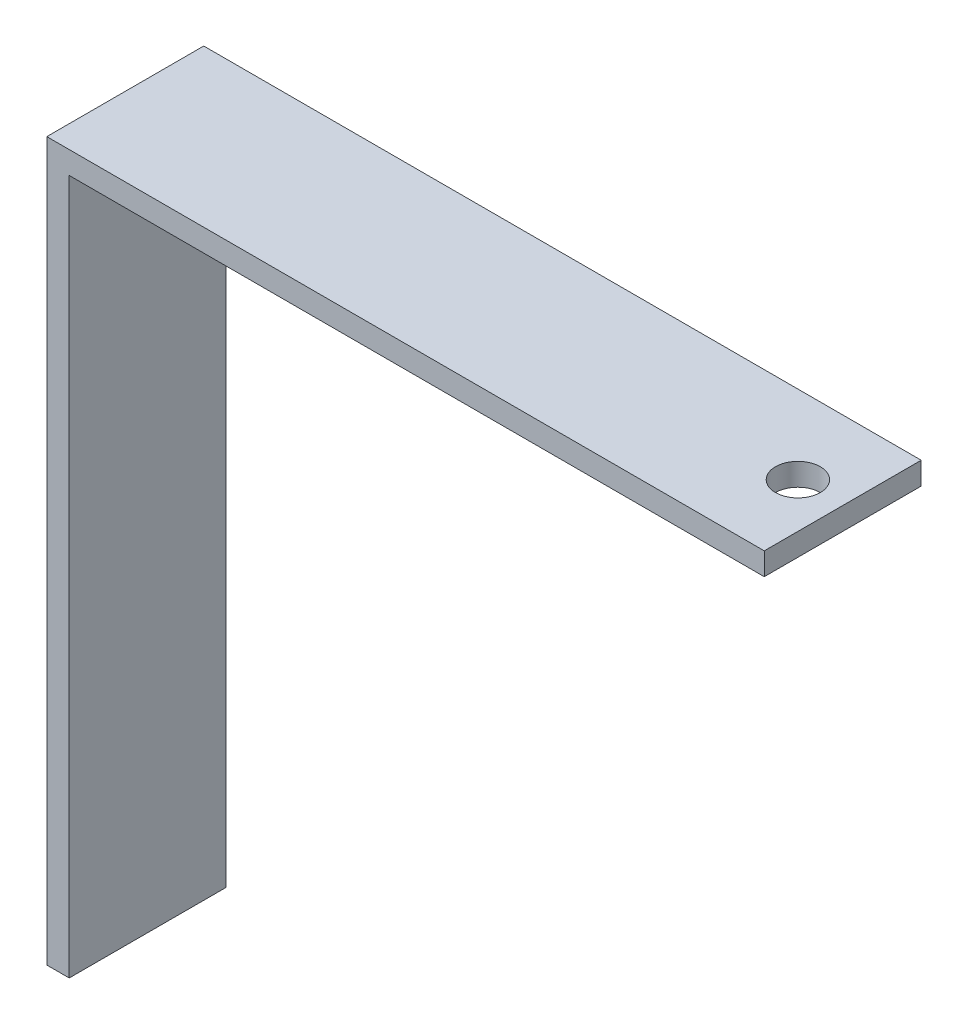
ISO-10303-21;
HEADER;
FILE_DESCRIPTION(('STEP AP214'),'2;1');
FILE_NAME('part.step','',(''),(''),'','','');
FILE_SCHEMA(('AUTOMOTIVE_DESIGN { 1 0 10303 214 1 1 1 1 }'));
ENDSEC;
DATA;
#1=APPLICATION_CONTEXT('core data for automotive mechanical design processes');
#2=APPLICATION_PROTOCOL_DEFINITION('international standard','automotive_design',2000,#1);
#3=PRODUCT_CONTEXT('',#1,'mechanical');
#4=PRODUCT('Part','Part','',(#3));
#5=PRODUCT_RELATED_PRODUCT_CATEGORY('part','',(#4));
#6=PRODUCT_DEFINITION_FORMATION('','',#4);
#7=PRODUCT_DEFINITION_CONTEXT('part definition',#1,'design');
#8=PRODUCT_DEFINITION('design','',#6,#7);
#9=PRODUCT_DEFINITION_SHAPE('','',#8);
#10=(LENGTH_UNIT() NAMED_UNIT(*) SI_UNIT(.MILLI.,.METRE.));
#11=(NAMED_UNIT(*) PLANE_ANGLE_UNIT() SI_UNIT($,.RADIAN.));
#12=(NAMED_UNIT(*) SI_UNIT($,.STERADIAN.) SOLID_ANGLE_UNIT());
#13=UNCERTAINTY_MEASURE_WITH_UNIT(LENGTH_MEASURE(1.E-05),#10,'distance_accuracy_value','');
#14=(GEOMETRIC_REPRESENTATION_CONTEXT(3) GLOBAL_UNCERTAINTY_ASSIGNED_CONTEXT((#13)) GLOBAL_UNIT_ASSIGNED_CONTEXT((#10,
#11,#12)) REPRESENTATION_CONTEXT('',''));
#15=CARTESIAN_POINT('',(0.,0.,0.));
#16=DIRECTION('',(0.,0.,1.));
#17=DIRECTION('',(1.,0.,0.));
#18=AXIS2_PLACEMENT_3D('',#15,#16,#17);
#19=CARTESIAN_POINT('',(0.,98.425,22.225));
#20=DIRECTION('',(0.,1.,0.));
#21=DIRECTION('',(0.,0.,1.));
#22=AXIS2_PLACEMENT_3D('',#19,#20,#21);
#23=PLANE('',#22);
#24=CARTESIAN_POINT('',(95.25,98.425,11.1125));
#25=DIRECTION('',(0.,1.,0.));
#26=DIRECTION('',(0.,0.,1.));
#27=AXIS2_PLACEMENT_3D('',#24,#25,#26);
#28=CIRCLE('',#27,3.175);
#29=CARTESIAN_POINT('',(95.25,98.425,14.2875));
#30=VERTEX_POINT('',#29);
#31=EDGE_CURVE('E115',#30,#30,#28,.F.);
#32=ORIENTED_EDGE('',*,*,#31,.F.);
#33=EDGE_LOOP('',(#32));
#34=FACE_BOUND('',#33,.T.);
#35=DIRECTION('',(1.,0.,0.));
#36=VECTOR('',#35,1.);
#37=CARTESIAN_POINT('',(0.,98.425,0.));
#38=LINE('',#37,#36);
#39=CARTESIAN_POINT('',(3.175,98.425,0.));
#40=VERTEX_POINT('',#39);
#41=CARTESIAN_POINT('',(101.6,98.425,0.));
#42=VERTEX_POINT('',#41);
#43=EDGE_CURVE('E111',#40,#42,#38,.T.);
#44=ORIENTED_EDGE('',*,*,#43,.T.);
#45=DIRECTION('',(0.,0.,-1.));
#46=VECTOR('',#45,1.);
#47=CARTESIAN_POINT('',(101.6,98.425,22.225));
#48=LINE('',#47,#46);
#49=CARTESIAN_POINT('',(101.6,98.425,22.225));
#50=VERTEX_POINT('',#49);
#51=EDGE_CURVE('E11',#50,#42,#48,.T.);
#52=ORIENTED_EDGE('',*,*,#51,.F.);
#53=DIRECTION('',(1.,0.,0.));
#54=VECTOR('',#53,1.);
#55=CARTESIAN_POINT('',(0.,98.425,22.225));
#56=LINE('',#55,#54);
#57=CARTESIAN_POINT('',(3.175,98.425,22.225));
#58=VERTEX_POINT('',#57);
#59=EDGE_CURVE('E76',#58,#50,#56,.T.);
#60=ORIENTED_EDGE('',*,*,#59,.F.);
#61=DIRECTION('',(0.,0.,-1.));
#62=VECTOR('',#61,1.);
#63=CARTESIAN_POINT('',(3.175,98.425,22.225));
#64=LINE('',#63,#62);
#65=EDGE_CURVE('E107',#58,#40,#64,.T.);
#66=ORIENTED_EDGE('',*,*,#65,.T.);
#67=EDGE_LOOP('',(#44,#52,#60,#66));
#68=FACE_BOUND('',#67,.T.);
#69=ADVANCED_FACE('F30',(#34,#68),#23,.F.);
#70=CARTESIAN_POINT('',(101.6,101.6,22.225));
#71=DIRECTION('',(1.,0.,0.));
#72=DIRECTION('',(0.,0.,-1.));
#73=AXIS2_PLACEMENT_3D('',#70,#71,#72);
#74=PLANE('',#73);
#75=DIRECTION('',(0.,-1.,0.));
#76=VECTOR('',#75,1.);
#77=CARTESIAN_POINT('',(101.6,101.6,0.));
#78=LINE('',#77,#76);
#79=CARTESIAN_POINT('',(101.6,101.6,0.));
#80=VERTEX_POINT('',#79);
#81=EDGE_CURVE('E114',#80,#42,#78,.T.);
#82=ORIENTED_EDGE('',*,*,#81,.F.);
#83=DIRECTION('',(0.,0.,-1.));
#84=VECTOR('',#83,1.);
#85=CARTESIAN_POINT('',(101.6,101.6,22.225));
#86=LINE('',#85,#84);
#87=CARTESIAN_POINT('',(101.6,101.6,22.225));
#88=VERTEX_POINT('',#87);
#89=EDGE_CURVE('E38',#88,#80,#86,.T.);
#90=ORIENTED_EDGE('',*,*,#89,.F.);
#91=DIRECTION('',(0.,-1.,0.));
#92=VECTOR('',#91,1.);
#93=CARTESIAN_POINT('',(101.6,101.6,22.225));
#94=LINE('',#93,#92);
#95=EDGE_CURVE('E162',#88,#50,#94,.T.);
#96=ORIENTED_EDGE('',*,*,#95,.T.);
#97=ORIENTED_EDGE('',*,*,#51,.T.);
#98=EDGE_LOOP('',(#82,#90,#96,#97));
#99=FACE_BOUND('',#98,.T.);
#100=ADVANCED_FACE('F133',(#99),#74,.T.);
#101=CARTESIAN_POINT('',(0.,101.6,22.225));
#102=DIRECTION('',(0.,1.,0.));
#103=DIRECTION('',(0.,0.,1.));
#104=AXIS2_PLACEMENT_3D('',#101,#102,#103);
#105=PLANE('',#104);
#106=CARTESIAN_POINT('',(95.25,101.6,11.1125));
#107=DIRECTION('',(0.,1.,0.));
#108=DIRECTION('',(0.,0.,1.));
#109=AXIS2_PLACEMENT_3D('',#106,#107,#108);
#110=CIRCLE('',#109,3.175);
#111=CARTESIAN_POINT('',(95.25,101.6,14.2875));
#112=VERTEX_POINT('',#111);
#113=EDGE_CURVE('E156',#112,#112,#110,.T.);
#114=ORIENTED_EDGE('',*,*,#113,.F.);
#115=EDGE_LOOP('',(#114));
#116=FACE_BOUND('',#115,.T.);
#117=DIRECTION('',(1.,0.,0.));
#118=VECTOR('',#117,1.);
#119=CARTESIAN_POINT('',(0.,101.6,0.));
#120=LINE('',#119,#118);
#121=CARTESIAN_POINT('',(0.,101.6,0.));
#122=VERTEX_POINT('',#121);
#123=EDGE_CURVE('E118',#122,#80,#120,.T.);
#124=ORIENTED_EDGE('',*,*,#123,.F.);
#125=DIRECTION('',(0.,0.,-1.));
#126=VECTOR('',#125,1.);
#127=CARTESIAN_POINT('',(0.,101.6,22.225));
#128=LINE('',#127,#126);
#129=CARTESIAN_POINT('',(0.,101.6,22.225));
#130=VERTEX_POINT('',#129);
#131=EDGE_CURVE('E97',#130,#122,#128,.T.);
#132=ORIENTED_EDGE('',*,*,#131,.F.);
#133=DIRECTION('',(1.,0.,0.));
#134=VECTOR('',#133,1.);
#135=CARTESIAN_POINT('',(0.,101.6,22.225));
#136=LINE('',#135,#134);
#137=EDGE_CURVE('E103',#130,#88,#136,.T.);
#138=ORIENTED_EDGE('',*,*,#137,.T.);
#139=ORIENTED_EDGE('',*,*,#89,.T.);
#140=EDGE_LOOP('',(#124,#132,#138,#139));
#141=FACE_BOUND('',#140,.T.);
#142=ADVANCED_FACE('F130',(#116,#141),#105,.T.);
#143=CARTESIAN_POINT('',(0.,0.,22.225));
#144=DIRECTION('',(-1.,0.,0.));
#145=DIRECTION('',(0.,0.,1.));
#146=AXIS2_PLACEMENT_3D('',#143,#144,#145);
#147=PLANE('',#146);
#148=DIRECTION('',(0.,1.,0.));
#149=VECTOR('',#148,1.);
#150=CARTESIAN_POINT('',(0.,0.,0.));
#151=LINE('',#150,#149);
#152=CARTESIAN_POINT('',(0.,0.,0.));
#153=VERTEX_POINT('',#152);
#154=EDGE_CURVE('E92',#153,#122,#151,.T.);
#155=ORIENTED_EDGE('',*,*,#154,.F.);
#156=DIRECTION('',(0.,0.,-1.));
#157=VECTOR('',#156,1.);
#158=CARTESIAN_POINT('',(0.,0.,22.225));
#159=LINE('',#158,#157);
#160=CARTESIAN_POINT('',(0.,0.,22.225));
#161=VERTEX_POINT('',#160);
#162=EDGE_CURVE('E87',#161,#153,#159,.T.);
#163=ORIENTED_EDGE('',*,*,#162,.F.);
#164=DIRECTION('',(0.,1.,0.));
#165=VECTOR('',#164,1.);
#166=CARTESIAN_POINT('',(0.,0.,22.225));
#167=LINE('',#166,#165);
#168=EDGE_CURVE('E90',#161,#130,#167,.T.);
#169=ORIENTED_EDGE('',*,*,#168,.T.);
#170=ORIENTED_EDGE('',*,*,#131,.T.);
#171=EDGE_LOOP('',(#155,#163,#169,#170));
#172=FACE_BOUND('',#171,.T.);
#173=ADVANCED_FACE('F89',(#172),#147,.T.);
#174=CARTESIAN_POINT('',(3.175,0.,22.225));
#175=DIRECTION('',(0.,-1.,0.));
#176=DIRECTION('',(0.,0.,-1.));
#177=AXIS2_PLACEMENT_3D('',#174,#175,#176);
#178=PLANE('',#177);
#179=DIRECTION('',(-1.,0.,0.));
#180=VECTOR('',#179,1.);
#181=CARTESIAN_POINT('',(3.175,0.,0.));
#182=LINE('',#181,#180);
#183=CARTESIAN_POINT('',(3.175,0.,0.));
#184=VERTEX_POINT('',#183);
#185=EDGE_CURVE('E122',#184,#153,#182,.T.);
#186=ORIENTED_EDGE('',*,*,#185,.F.);
#187=DIRECTION('',(0.,0.,-1.));
#188=VECTOR('',#187,1.);
#189=CARTESIAN_POINT('',(3.175,0.,22.225));
#190=LINE('',#189,#188);
#191=CARTESIAN_POINT('',(3.175,0.,22.225));
#192=VERTEX_POINT('',#191);
#193=EDGE_CURVE('E67',#192,#184,#190,.T.);
#194=ORIENTED_EDGE('',*,*,#193,.F.);
#195=DIRECTION('',(-1.,0.,0.));
#196=VECTOR('',#195,1.);
#197=CARTESIAN_POINT('',(3.175,0.,22.225));
#198=LINE('',#197,#196);
#199=EDGE_CURVE('E101',#192,#161,#198,.T.);
#200=ORIENTED_EDGE('',*,*,#199,.T.);
#201=ORIENTED_EDGE('',*,*,#162,.T.);
#202=EDGE_LOOP('',(#186,#194,#200,#201));
#203=FACE_BOUND('',#202,.T.);
#204=ADVANCED_FACE('F105',(#203),#178,.T.);
#205=CARTESIAN_POINT('',(3.175,0.,22.225));
#206=DIRECTION('',(-1.,0.,0.));
#207=DIRECTION('',(0.,0.,1.));
#208=AXIS2_PLACEMENT_3D('',#205,#206,#207);
#209=PLANE('',#208);
#210=DIRECTION('',(0.,1.,0.));
#211=VECTOR('',#210,1.);
#212=CARTESIAN_POINT('',(3.175,0.,0.));
#213=LINE('',#212,#211);
#214=EDGE_CURVE('E70',#184,#40,#213,.T.);
#215=ORIENTED_EDGE('',*,*,#214,.T.);
#216=ORIENTED_EDGE('',*,*,#65,.F.);
#217=DIRECTION('',(0.,1.,0.));
#218=VECTOR('',#217,1.);
#219=CARTESIAN_POINT('',(3.175,0.,22.225));
#220=LINE('',#219,#218);
#221=EDGE_CURVE('E46',#192,#58,#220,.T.);
#222=ORIENTED_EDGE('',*,*,#221,.F.);
#223=ORIENTED_EDGE('',*,*,#193,.T.);
#224=EDGE_LOOP('',(#215,#216,#222,#223));
#225=FACE_BOUND('',#224,.T.);
#226=ADVANCED_FACE('F138',(#225),#209,.F.);
#227=CARTESIAN_POINT('',(101.6,98.425,22.225));
#228=DIRECTION('',(0.,0.,-1.));
#229=DIRECTION('',(-1.,0.,0.));
#230=AXIS2_PLACEMENT_3D('',#227,#228,#229);
#231=PLANE('',#230);
#232=ORIENTED_EDGE('',*,*,#59,.T.);
#233=ORIENTED_EDGE('',*,*,#95,.F.);
#234=ORIENTED_EDGE('',*,*,#137,.F.);
#235=ORIENTED_EDGE('',*,*,#168,.F.);
#236=ORIENTED_EDGE('',*,*,#199,.F.);
#237=ORIENTED_EDGE('',*,*,#221,.T.);
#238=EDGE_LOOP('',(#232,#233,#234,#235,#236,#237));
#239=FACE_BOUND('',#238,.T.);
#240=ADVANCED_FACE('F100',(#239),#231,.F.);
#241=CARTESIAN_POINT('',(101.6,98.425,0.));
#242=DIRECTION('',(0.,0.,-1.));
#243=DIRECTION('',(-1.,0.,0.));
#244=AXIS2_PLACEMENT_3D('',#241,#242,#243);
#245=PLANE('',#244);
#246=ORIENTED_EDGE('',*,*,#43,.F.);
#247=ORIENTED_EDGE('',*,*,#214,.F.);
#248=ORIENTED_EDGE('',*,*,#185,.T.);
#249=ORIENTED_EDGE('',*,*,#154,.T.);
#250=ORIENTED_EDGE('',*,*,#123,.T.);
#251=ORIENTED_EDGE('',*,*,#81,.T.);
#252=EDGE_LOOP('',(#246,#247,#248,#249,#250,#251));
#253=FACE_BOUND('',#252,.T.);
#254=ADVANCED_FACE('F136',(#253),#245,.T.);
#255=CARTESIAN_POINT('',(95.25,-0.001000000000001,11.1125));
#256=DIRECTION('',(0.,1.,0.));
#257=DIRECTION('',(0.,0.,1.));
#258=AXIS2_PLACEMENT_3D('',#255,#256,#257);
#259=CYLINDRICAL_SURFACE('',#258,3.175);
#260=ORIENTED_EDGE('',*,*,#113,.T.);
#261=EDGE_LOOP('',(#260));
#262=FACE_BOUND('',#261,.T.);
#263=ORIENTED_EDGE('',*,*,#31,.T.);
#264=EDGE_LOOP('',(#263));
#265=FACE_BOUND('',#264,.T.);
#266=ADVANCED_FACE('F165',(#262,#265),#259,.F.);
#267=CLOSED_SHELL('',(#69,#100,#142,#173,#204,#226,#240,#254,#266));
#268=MANIFOLD_SOLID_BREP('B2',#267);
#269=ADVANCED_BREP_SHAPE_REPRESENTATION('',(#18,#268),#14);
#270=SHAPE_DEFINITION_REPRESENTATION(#9,#269);
ENDSEC;
END-ISO-10303-21;
